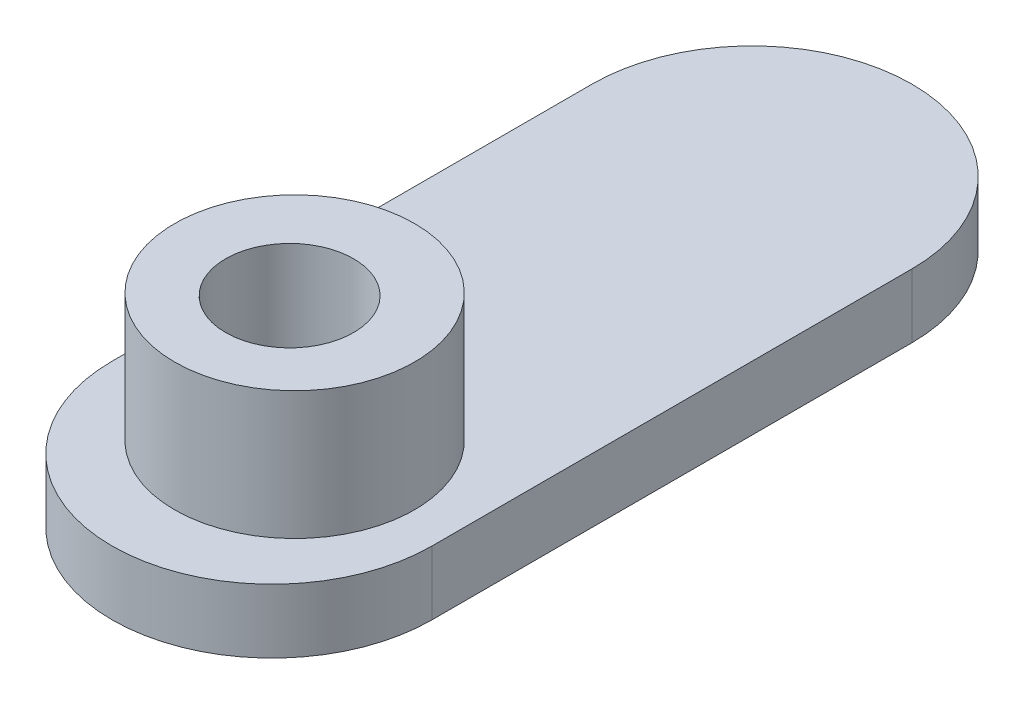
ISO-10303-21;
HEADER;
FILE_DESCRIPTION(('STEP AP214'),'2;1');
FILE_NAME('part.step','',(''),(''),'','','');
FILE_SCHEMA(('AUTOMOTIVE_DESIGN { 1 0 10303 214 1 1 1 1 }'));
ENDSEC;
DATA;
#1=APPLICATION_CONTEXT('core data for automotive mechanical design processes');
#2=APPLICATION_PROTOCOL_DEFINITION('international standard','automotive_design',2000,#1);
#3=PRODUCT_CONTEXT('',#1,'mechanical');
#4=PRODUCT('Part','Part','',(#3));
#5=PRODUCT_RELATED_PRODUCT_CATEGORY('part','',(#4));
#6=PRODUCT_DEFINITION_FORMATION('','',#4);
#7=PRODUCT_DEFINITION_CONTEXT('part definition',#1,'design');
#8=PRODUCT_DEFINITION('design','',#6,#7);
#9=PRODUCT_DEFINITION_SHAPE('','',#8);
#10=(LENGTH_UNIT() NAMED_UNIT(*) SI_UNIT(.MILLI.,.METRE.));
#11=(NAMED_UNIT(*) PLANE_ANGLE_UNIT() SI_UNIT($,.RADIAN.));
#12=(NAMED_UNIT(*) SI_UNIT($,.STERADIAN.) SOLID_ANGLE_UNIT());
#13=UNCERTAINTY_MEASURE_WITH_UNIT(LENGTH_MEASURE(1.E-05),#10,'distance_accuracy_value','');
#14=(GEOMETRIC_REPRESENTATION_CONTEXT(3) GLOBAL_UNCERTAINTY_ASSIGNED_CONTEXT((#13)) GLOBAL_UNIT_ASSIGNED_CONTEXT((#10,
#11,#12)) REPRESENTATION_CONTEXT('',''));
#15=CARTESIAN_POINT('',(0.,0.,0.));
#16=DIRECTION('',(0.,0.,1.));
#17=DIRECTION('',(1.,0.,0.));
#18=AXIS2_PLACEMENT_3D('',#15,#16,#17);
#19=CARTESIAN_POINT('',(0.,20.,0.));
#20=DIRECTION('',(0.,1.,0.));
#21=DIRECTION('',(0.,0.,1.));
#22=AXIS2_PLACEMENT_3D('',#19,#20,#21);
#23=PLANE('',#22);
#24=CARTESIAN_POINT('',(0.,20.,0.));
#25=DIRECTION('',(0.,1.,0.));
#26=DIRECTION('',(0.,0.,1.));
#27=AXIS2_PLACEMENT_3D('',#24,#25,#26);
#28=CIRCLE('',#27,50.);
#29=CARTESIAN_POINT('',(-50.,20.,0.));
#30=VERTEX_POINT('',#29);
#31=CARTESIAN_POINT('',(50.,20.,0.));
#32=VERTEX_POINT('',#31);
#33=EDGE_CURVE('E84',#30,#32,#28,.T.);
#34=ORIENTED_EDGE('',*,*,#33,.T.);
#35=DIRECTION('',(0.,0.,-1.));
#36=VECTOR('',#35,1.);
#37=CARTESIAN_POINT('',(50.,20.,0.));
#38=LINE('',#37,#36);
#39=CARTESIAN_POINT('',(50.,20.,-150.));
#40=VERTEX_POINT('',#39);
#41=EDGE_CURVE('E79',#32,#40,#38,.T.);
#42=ORIENTED_EDGE('',*,*,#41,.T.);
#43=CARTESIAN_POINT('',(0.,20.,-150.));
#44=DIRECTION('',(0.,1.,0.));
#45=DIRECTION('',(0.,0.,1.));
#46=AXIS2_PLACEMENT_3D('',#43,#44,#45);
#47=CIRCLE('',#46,50.);
#48=CARTESIAN_POINT('',(-50.,20.,-150.));
#49=VERTEX_POINT('',#48);
#50=EDGE_CURVE('E82',#40,#49,#47,.T.);
#51=ORIENTED_EDGE('',*,*,#50,.T.);
#52=DIRECTION('',(0.,0.,1.));
#53=VECTOR('',#52,1.);
#54=CARTESIAN_POINT('',(-50.,20.,0.));
#55=LINE('',#54,#53);
#56=EDGE_CURVE('E49',#49,#30,#55,.T.);
#57=ORIENTED_EDGE('',*,*,#56,.T.);
#58=EDGE_LOOP('',(#34,#42,#51,#57));
#59=FACE_BOUND('',#58,.T.);
#60=CARTESIAN_POINT('',(0.,20.,-7.05587524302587));
#61=DIRECTION('',(0.,1.,0.));
#62=DIRECTION('',(0.,0.,1.));
#63=AXIS2_PLACEMENT_3D('',#60,#61,#62);
#64=CIRCLE('',#63,37.5);
#65=CARTESIAN_POINT('',(0.,20.,30.4441247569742));
#66=VERTEX_POINT('',#65);
#67=EDGE_CURVE('E110',#66,#66,#64,.T.);
#68=ORIENTED_EDGE('',*,*,#67,.F.);
#69=EDGE_LOOP('',(#68));
#70=FACE_BOUND('',#69,.T.);
#71=ADVANCED_FACE('F32',(#59,#70),#23,.T.);
#72=CARTESIAN_POINT('',(0.,20.,0.));
#73=DIRECTION('',(0.,-1.,0.));
#74=DIRECTION('',(0.,0.,-1.));
#75=AXIS2_PLACEMENT_3D('',#72,#73,#74);
#76=CYLINDRICAL_SURFACE('',#75,50.);
#77=CARTESIAN_POINT('',(0.,0.,0.));
#78=DIRECTION('',(0.,1.,0.));
#79=DIRECTION('',(0.,0.,1.));
#80=AXIS2_PLACEMENT_3D('',#77,#78,#79);
#81=CIRCLE('',#80,50.);
#82=CARTESIAN_POINT('',(-50.,0.,0.));
#83=VERTEX_POINT('',#82);
#84=CARTESIAN_POINT('',(50.,0.,0.));
#85=VERTEX_POINT('',#84);
#86=EDGE_CURVE('E96',#83,#85,#81,.T.);
#87=ORIENTED_EDGE('',*,*,#86,.T.);
#88=DIRECTION('',(0.,-1.,0.));
#89=VECTOR('',#88,1.);
#90=CARTESIAN_POINT('',(50.,20.,0.));
#91=LINE('',#90,#89);
#92=EDGE_CURVE('E11',#32,#85,#91,.T.);
#93=ORIENTED_EDGE('',*,*,#92,.F.);
#94=ORIENTED_EDGE('',*,*,#33,.F.);
#95=DIRECTION('',(0.,-1.,0.));
#96=VECTOR('',#95,1.);
#97=CARTESIAN_POINT('',(-50.,20.,0.));
#98=LINE('',#97,#96);
#99=EDGE_CURVE('E92',#30,#83,#98,.T.);
#100=ORIENTED_EDGE('',*,*,#99,.T.);
#101=EDGE_LOOP('',(#87,#93,#94,#100));
#102=FACE_BOUND('',#101,.T.);
#103=ADVANCED_FACE('F34',(#102),#76,.T.);
#104=CARTESIAN_POINT('',(50.,20.,0.));
#105=DIRECTION('',(-1.,0.,0.));
#106=DIRECTION('',(0.,0.,1.));
#107=AXIS2_PLACEMENT_3D('',#104,#105,#106);
#108=PLANE('',#107);
#109=DIRECTION('',(0.,0.,-1.));
#110=VECTOR('',#109,1.);
#111=CARTESIAN_POINT('',(50.,0.,0.));
#112=LINE('',#111,#110);
#113=CARTESIAN_POINT('',(50.,0.,-150.));
#114=VERTEX_POINT('',#113);
#115=EDGE_CURVE('E88',#85,#114,#112,.T.);
#116=ORIENTED_EDGE('',*,*,#115,.T.);
#117=DIRECTION('',(0.,-1.,0.));
#118=VECTOR('',#117,1.);
#119=CARTESIAN_POINT('',(50.,20.,-150.));
#120=LINE('',#119,#118);
#121=EDGE_CURVE('E41',#40,#114,#120,.T.);
#122=ORIENTED_EDGE('',*,*,#121,.F.);
#123=ORIENTED_EDGE('',*,*,#41,.F.);
#124=ORIENTED_EDGE('',*,*,#92,.T.);
#125=EDGE_LOOP('',(#116,#122,#123,#124));
#126=FACE_BOUND('',#125,.T.);
#127=ADVANCED_FACE('F87',(#126),#108,.F.);
#128=CARTESIAN_POINT('',(0.,20.,-150.));
#129=DIRECTION('',(0.,-1.,0.));
#130=DIRECTION('',(0.,0.,-1.));
#131=AXIS2_PLACEMENT_3D('',#128,#129,#130);
#132=CYLINDRICAL_SURFACE('',#131,50.);
#133=CARTESIAN_POINT('',(0.,0.,-150.));
#134=DIRECTION('',(0.,1.,0.));
#135=DIRECTION('',(0.,0.,1.));
#136=AXIS2_PLACEMENT_3D('',#133,#134,#135);
#137=CIRCLE('',#136,50.);
#138=CARTESIAN_POINT('',(-50.,0.,-150.));
#139=VERTEX_POINT('',#138);
#140=EDGE_CURVE('E66',#114,#139,#137,.T.);
#141=ORIENTED_EDGE('',*,*,#140,.T.);
#142=DIRECTION('',(0.,-1.,0.));
#143=VECTOR('',#142,1.);
#144=CARTESIAN_POINT('',(-50.,20.,-150.));
#145=LINE('',#144,#143);
#146=EDGE_CURVE('E89',#49,#139,#145,.T.);
#147=ORIENTED_EDGE('',*,*,#146,.F.);
#148=ORIENTED_EDGE('',*,*,#50,.F.);
#149=ORIENTED_EDGE('',*,*,#121,.T.);
#150=EDGE_LOOP('',(#141,#147,#148,#149));
#151=FACE_BOUND('',#150,.T.);
#152=ADVANCED_FACE('F90',(#151),#132,.T.);
#153=CARTESIAN_POINT('',(-50.,20.,0.));
#154=DIRECTION('',(1.,0.,0.));
#155=DIRECTION('',(0.,0.,-1.));
#156=AXIS2_PLACEMENT_3D('',#153,#154,#155);
#157=PLANE('',#156);
#158=DIRECTION('',(0.,0.,1.));
#159=VECTOR('',#158,1.);
#160=CARTESIAN_POINT('',(-50.,0.,0.));
#161=LINE('',#160,#159);
#162=EDGE_CURVE('E72',#139,#83,#161,.T.);
#163=ORIENTED_EDGE('',*,*,#162,.T.);
#164=ORIENTED_EDGE('',*,*,#99,.F.);
#165=ORIENTED_EDGE('',*,*,#56,.F.);
#166=ORIENTED_EDGE('',*,*,#146,.T.);
#167=EDGE_LOOP('',(#163,#164,#165,#166));
#168=FACE_BOUND('',#167,.T.);
#169=ADVANCED_FACE('F104',(#168),#157,.F.);
#170=CARTESIAN_POINT('',(0.,0.,0.));
#171=DIRECTION('',(0.,1.,0.));
#172=DIRECTION('',(0.,0.,1.));
#173=AXIS2_PLACEMENT_3D('',#170,#171,#172);
#174=PLANE('',#173);
#175=CARTESIAN_POINT('',(0.,0.,-5.5));
#176=DIRECTION('',(0.,1.,0.));
#177=DIRECTION('',(0.,0.,1.));
#178=AXIS2_PLACEMENT_3D('',#175,#176,#177);
#179=CIRCLE('',#178,20.);
#180=CARTESIAN_POINT('',(0.,0.,14.5));
#181=VERTEX_POINT('',#180);
#182=EDGE_CURVE('E113',#181,#181,#179,.T.);
#183=ORIENTED_EDGE('',*,*,#182,.T.);
#184=EDGE_LOOP('',(#183));
#185=FACE_BOUND('',#184,.T.);
#186=ORIENTED_EDGE('',*,*,#86,.F.);
#187=ORIENTED_EDGE('',*,*,#162,.F.);
#188=ORIENTED_EDGE('',*,*,#140,.F.);
#189=ORIENTED_EDGE('',*,*,#115,.F.);
#190=EDGE_LOOP('',(#186,#187,#188,#189));
#191=FACE_BOUND('',#190,.T.);
#192=ADVANCED_FACE('F107',(#185,#191),#174,.F.);
#193=CARTESIAN_POINT('',(0.,60.,-7.05587524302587));
#194=DIRECTION('',(0.,-1.,0.));
#195=DIRECTION('',(0.,0.,-1.));
#196=AXIS2_PLACEMENT_3D('',#193,#194,#195);
#197=CYLINDRICAL_SURFACE('',#196,37.5);
#198=CARTESIAN_POINT('',(0.,60.,-7.05587524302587));
#199=DIRECTION('',(0.,1.,0.));
#200=DIRECTION('',(0.,0.,1.));
#201=AXIS2_PLACEMENT_3D('',#198,#199,#200);
#202=CIRCLE('',#201,37.5);
#203=CARTESIAN_POINT('',(0.,60.,30.4441247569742));
#204=VERTEX_POINT('',#203);
#205=EDGE_CURVE('E99',#204,#204,#202,.T.);
#206=ORIENTED_EDGE('',*,*,#205,.F.);
#207=EDGE_LOOP('',(#206));
#208=FACE_BOUND('',#207,.T.);
#209=ORIENTED_EDGE('',*,*,#67,.T.);
#210=EDGE_LOOP('',(#209));
#211=FACE_BOUND('',#210,.T.);
#212=ADVANCED_FACE('F132',(#208,#211),#197,.T.);
#213=CARTESIAN_POINT('',(0.,60.,-7.05587524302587));
#214=DIRECTION('',(0.,1.,0.));
#215=DIRECTION('',(0.,0.,1.));
#216=AXIS2_PLACEMENT_3D('',#213,#214,#215);
#217=PLANE('',#216);
#218=CARTESIAN_POINT('',(0.,60.,-5.5));
#219=DIRECTION('',(0.,1.,0.));
#220=DIRECTION('',(0.,0.,1.));
#221=AXIS2_PLACEMENT_3D('',#218,#219,#220);
#222=CIRCLE('',#221,20.);
#223=CARTESIAN_POINT('',(0.,60.,14.5));
#224=VERTEX_POINT('',#223);
#225=EDGE_CURVE('E116',#224,#224,#222,.T.);
#226=ORIENTED_EDGE('',*,*,#225,.F.);
#227=EDGE_LOOP('',(#226));
#228=FACE_BOUND('',#227,.T.);
#229=ORIENTED_EDGE('',*,*,#205,.T.);
#230=EDGE_LOOP('',(#229));
#231=FACE_BOUND('',#230,.T.);
#232=ADVANCED_FACE('F126',(#228,#231),#217,.T.);
#233=CARTESIAN_POINT('',(0.,0.,-5.5));
#234=DIRECTION('',(0.,1.,0.));
#235=DIRECTION('',(0.,0.,1.));
#236=AXIS2_PLACEMENT_3D('',#233,#234,#235);
#237=CYLINDRICAL_SURFACE('',#236,20.);
#238=ORIENTED_EDGE('',*,*,#182,.F.);
#239=EDGE_LOOP('',(#238));
#240=FACE_BOUND('',#239,.T.);
#241=ORIENTED_EDGE('',*,*,#225,.T.);
#242=EDGE_LOOP('',(#241));
#243=FACE_BOUND('',#242,.T.);
#244=ADVANCED_FACE('F123',(#240,#243),#237,.F.);
#245=CLOSED_SHELL('',(#71,#103,#127,#152,#169,#192,#212,#232,#244));
#246=MANIFOLD_SOLID_BREP('B2',#245);
#247=ADVANCED_BREP_SHAPE_REPRESENTATION('',(#18,#246),#14);
#248=SHAPE_DEFINITION_REPRESENTATION(#9,#247);
ENDSEC;
END-ISO-10303-21;
